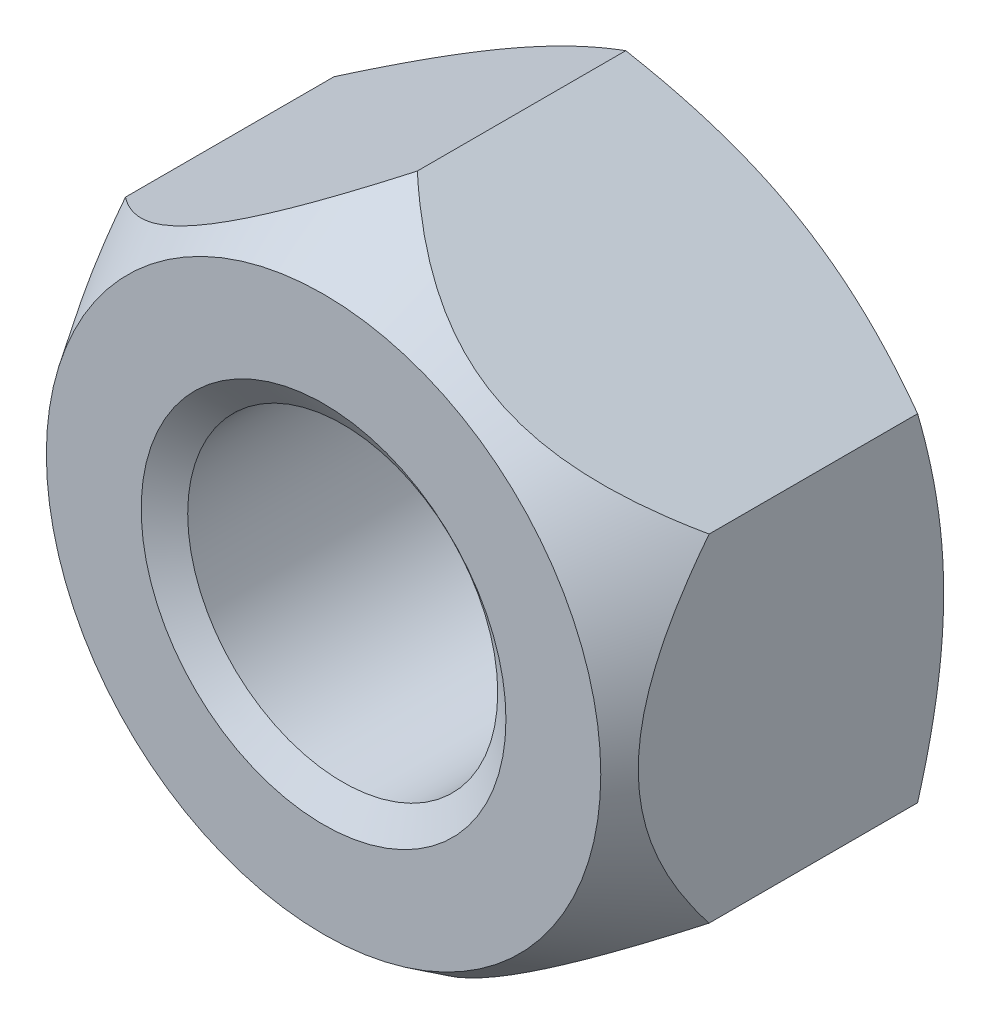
ISO-10303-21;
HEADER;
FILE_DESCRIPTION(('STEP AP214'),'2;1');
FILE_NAME('part.step','',(''),(''),'','','');
FILE_SCHEMA(('AUTOMOTIVE_DESIGN { 1 0 10303 214 1 1 1 1 }'));
ENDSEC;
DATA;
#1=APPLICATION_CONTEXT('core data for automotive mechanical design processes');
#2=APPLICATION_PROTOCOL_DEFINITION('international standard','automotive_design',2000,#1);
#3=PRODUCT_CONTEXT('',#1,'mechanical');
#4=PRODUCT('Part','Part','',(#3));
#5=PRODUCT_RELATED_PRODUCT_CATEGORY('part','',(#4));
#6=PRODUCT_DEFINITION_FORMATION('','',#4);
#7=PRODUCT_DEFINITION_CONTEXT('part definition',#1,'design');
#8=PRODUCT_DEFINITION('design','',#6,#7);
#9=PRODUCT_DEFINITION_SHAPE('','',#8);
#10=(LENGTH_UNIT() NAMED_UNIT(*) SI_UNIT(.MILLI.,.METRE.));
#11=(NAMED_UNIT(*) PLANE_ANGLE_UNIT() SI_UNIT($,.RADIAN.));
#12=(NAMED_UNIT(*) SI_UNIT($,.STERADIAN.) SOLID_ANGLE_UNIT());
#13=UNCERTAINTY_MEASURE_WITH_UNIT(LENGTH_MEASURE(1.E-05),#10,'distance_accuracy_value','');
#14=(GEOMETRIC_REPRESENTATION_CONTEXT(3) GLOBAL_UNCERTAINTY_ASSIGNED_CONTEXT((#13)) GLOBAL_UNIT_ASSIGNED_CONTEXT((#10,
#11,#12)) REPRESENTATION_CONTEXT('',''));
#15=CARTESIAN_POINT('',(0.,0.,0.));
#16=DIRECTION('',(0.,0.,1.));
#17=DIRECTION('',(1.,0.,0.));
#18=AXIS2_PLACEMENT_3D('',#15,#16,#17);
#19=CARTESIAN_POINT('',(0.,0.,-9.));
#20=DIRECTION('',(0.,0.,1.));
#21=DIRECTION('',(1.,0.,0.));
#22=AXIS2_PLACEMENT_3D('',#19,#20,#21);
#23=CYLINDRICAL_SURFACE('',#22,4.25);
#24=CARTESIAN_POINT('',(0.,0.,-0.525155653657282));
#25=DIRECTION('',(0.,0.,1.));
#26=DIRECTION('',(1.,0.,0.));
#27=AXIS2_PLACEMENT_3D('',#24,#25,#26);
#28=CIRCLE('',#27,4.25);
#29=CARTESIAN_POINT('',(4.25,0.,-0.525155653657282));
#30=VERTEX_POINT('',#29);
#31=EDGE_CURVE('E146',#30,#30,#28,.F.);
#32=ORIENTED_EDGE('',*,*,#31,.F.);
#33=EDGE_LOOP('',(#32));
#34=FACE_BOUND('',#33,.T.);
#35=CARTESIAN_POINT('',(0.,0.,-8.44944434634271));
#36=DIRECTION('',(0.,0.,-1.));
#37=DIRECTION('',(-1.,0.,0.));
#38=AXIS2_PLACEMENT_3D('',#35,#36,#37);
#39=CIRCLE('',#38,4.25);
#40=CARTESIAN_POINT('',(-4.25,0.,-8.44944434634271));
#41=VERTEX_POINT('',#40);
#42=EDGE_CURVE('E35',#41,#41,#39,.F.);
#43=ORIENTED_EDGE('',*,*,#42,.F.);
#44=EDGE_LOOP('',(#43));
#45=FACE_BOUND('',#44,.T.);
#46=ADVANCED_FACE('F30',(#34,#45),#23,.F.);
#47=CARTESIAN_POINT('',(0.,9.23760430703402,-9.));
#48=DIRECTION('',(0.,0.,-1.));
#49=DIRECTION('',(-1.,0.,0.));
#50=AXIS2_PLACEMENT_3D('',#47,#48,#49);
#51=PLANE('',#50);
#52=CARTESIAN_POINT('',(0.,0.,-9.));
#53=DIRECTION('',(0.,0.,-1.));
#54=DIRECTION('',(-1.,0.,0.));
#55=AXIS2_PLACEMENT_3D('',#52,#53,#54);
#56=CIRCLE('',#55,8.);
#57=CARTESIAN_POINT('',(-8.,0.,-9.));
#58=VERTEX_POINT('',#57);
#59=CARTESIAN_POINT('',(-4.00000000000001,-6.92820323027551,-9.));
#60=VERTEX_POINT('',#59);
#61=EDGE_CURVE('E11',#58,#60,#56,.F.);
#62=ORIENTED_EDGE('',*,*,#61,.F.);
#63=CARTESIAN_POINT('',(-4.,6.92820323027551,-9.));
#64=VERTEX_POINT('',#63);
#65=EDGE_CURVE('E42',#64,#58,#56,.F.);
#66=ORIENTED_EDGE('',*,*,#65,.F.);
#67=CARTESIAN_POINT('',(4.00000000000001,6.9282032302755,-9.));
#68=VERTEX_POINT('',#67);
#69=EDGE_CURVE('E145',#68,#64,#56,.F.);
#70=ORIENTED_EDGE('',*,*,#69,.F.);
#71=CARTESIAN_POINT('',(0.,0.,-9.));
#72=DIRECTION('',(0.,0.,1.));
#73=DIRECTION('',(1.,0.,0.));
#74=AXIS2_PLACEMENT_3D('',#71,#72,#73);
#75=CIRCLE('',#74,8.);
#76=CARTESIAN_POINT('',(8.,0.,-9.));
#77=VERTEX_POINT('',#76);
#78=EDGE_CURVE('E426',#77,#68,#75,.T.);
#79=ORIENTED_EDGE('',*,*,#78,.F.);
#80=CARTESIAN_POINT('',(4.,-6.92820323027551,-9.));
#81=VERTEX_POINT('',#80);
#82=EDGE_CURVE('E440',#81,#77,#56,.F.);
#83=ORIENTED_EDGE('',*,*,#82,.F.);
#84=EDGE_CURVE('E40',#60,#81,#56,.F.);
#85=ORIENTED_EDGE('',*,*,#84,.F.);
#86=EDGE_LOOP('',(#62,#66,#70,#79,#83,#85));
#87=FACE_BOUND('',#86,.T.);
#88=CARTESIAN_POINT('',(0.,0.,-9.));
#89=DIRECTION('',(0.,0.,-1.));
#90=DIRECTION('',(-1.,0.,0.));
#91=AXIS2_PLACEMENT_3D('',#88,#89,#90);
#92=CIRCLE('',#91,5.);
#93=CARTESIAN_POINT('',(-5.,0.,-9.));
#94=VERTEX_POINT('',#93);
#95=EDGE_CURVE('E150',#94,#94,#92,.F.);
#96=ORIENTED_EDGE('',*,*,#95,.T.);
#97=EDGE_LOOP('',(#96));
#98=FACE_BOUND('',#97,.T.);
#99=ADVANCED_FACE('F214',(#87,#98),#51,.T.);
#100=CARTESIAN_POINT('',(0.,9.23760430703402,0.));
#101=DIRECTION('',(0.,0.,-1.));
#102=DIRECTION('',(-1.,0.,0.));
#103=AXIS2_PLACEMENT_3D('',#100,#101,#102);
#104=PLANE('',#103);
#105=CARTESIAN_POINT('',(0.,0.,0.));
#106=DIRECTION('',(0.,0.,1.));
#107=DIRECTION('',(1.,0.,0.));
#108=AXIS2_PLACEMENT_3D('',#105,#106,#107);
#109=CIRCLE('',#108,7.6);
#110=CARTESIAN_POINT('',(7.6,0.,0.));
#111=VERTEX_POINT('',#110);
#112=EDGE_CURVE('E148',#111,#111,#109,.T.);
#113=ORIENTED_EDGE('',*,*,#112,.T.);
#114=EDGE_LOOP('',(#113));
#115=FACE_BOUND('',#114,.T.);
#116=CARTESIAN_POINT('',(0.,0.,0.));
#117=DIRECTION('',(0.,0.,1.));
#118=DIRECTION('',(1.,0.,0.));
#119=AXIS2_PLACEMENT_3D('',#116,#117,#118);
#120=CIRCLE('',#119,5.);
#121=CARTESIAN_POINT('',(5.,0.,0.));
#122=VERTEX_POINT('',#121);
#123=EDGE_CURVE('E149',#122,#122,#120,.T.);
#124=ORIENTED_EDGE('',*,*,#123,.F.);
#125=EDGE_LOOP('',(#124));
#126=FACE_BOUND('',#125,.T.);
#127=ADVANCED_FACE('F266',(#115,#126),#104,.F.);
#128=CARTESIAN_POINT('',(0.,9.23760430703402,-9.));
#129=DIRECTION('',(-0.500000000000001,0.866025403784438,0.));
#130=DIRECTION('',(-0.866025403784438,-0.500000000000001,0.));
#131=AXIS2_PLACEMENT_3D('',#128,#129,#130);
#132=PLANE('',#131);
#133=DIRECTION('',(0.,0.,1.));
#134=VECTOR('',#133,1.);
#135=CARTESIAN_POINT('',(-8.,4.618802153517,-9.));
#136=LINE('',#135,#134);
#137=CARTESIAN_POINT('',(-8.,4.61880215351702,-8.28546882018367));
#138=VERTEX_POINT('',#137);
#139=CARTESIAN_POINT('',(-8.,4.618802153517,-2.56999999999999));
#140=VERTEX_POINT('',#139);
#141=EDGE_CURVE('E140',#138,#140,#136,.T.);
#142=ORIENTED_EDGE('',*,*,#141,.T.);
#143=CARTESIAN_POINT('',(-8.0002,4.61868668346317,-2.5701812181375));
#144=CARTESIAN_POINT('',(-7.9150840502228,4.66782839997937,-2.49306399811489));
#145=CARTESIAN_POINT('',(-7.8291989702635,4.71741417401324,-2.41708127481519));
#146=CARTESIAN_POINT('',(-7.65573743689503,4.81756223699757,-2.2676826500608));
#147=CARTESIAN_POINT('',(-7.56816055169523,4.86812477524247,-2.19426741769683));
#148=CARTESIAN_POINT('',(-7.30199770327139,5.02179396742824,-1.97778422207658));
#149=CARTESIAN_POINT('',(-7.12068103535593,5.1264771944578,-1.8391216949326));
#150=CARTESIAN_POINT('',(-6.74583954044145,5.34289203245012,-1.57413307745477));
#151=CARTESIAN_POINT('',(-6.55213408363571,5.45472793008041,-1.44814466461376));
#152=CARTESIAN_POINT('',(-6.1557929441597,5.68355559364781,-1.21711956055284));
#153=CARTESIAN_POINT('',(-5.95317372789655,5.80053785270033,-1.11204606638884));
#154=CARTESIAN_POINT('',(-5.61980314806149,5.99300944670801,-0.964407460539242));
#155=CARTESIAN_POINT('',(-5.49183349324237,6.06689276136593,-0.913443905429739));
#156=CARTESIAN_POINT('',(-5.23286494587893,6.21640832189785,-0.822900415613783));
#157=CARTESIAN_POINT('',(-5.10186591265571,6.29204064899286,-0.783321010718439));
#158=CARTESIAN_POINT('',(-4.83847998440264,6.44410658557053,-0.717166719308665));
#159=CARTESIAN_POINT('',(-4.70611197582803,6.52052929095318,-0.69049247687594));
#160=CARTESIAN_POINT('',(-4.43984570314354,6.67425819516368,-0.650725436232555));
#161=CARTESIAN_POINT('',(-4.30594753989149,6.75156433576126,-0.637631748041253));
#162=CARTESIAN_POINT('',(-4.03675995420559,6.90697986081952,-0.625539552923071));
#163=CARTESIAN_POINT('',(-3.90146725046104,6.98509113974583,-0.626637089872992));
#164=CARTESIAN_POINT('',(-3.63154168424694,7.14093273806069,-0.643111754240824));
#165=CARTESIAN_POINT('',(-3.49690883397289,7.21866305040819,-0.658489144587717));
#166=CARTESIAN_POINT('',(-3.22895584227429,7.37336578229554,-0.702935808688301));
#167=CARTESIAN_POINT('',(-3.09564081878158,7.45033524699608,-0.732045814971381));
#168=CARTESIAN_POINT('',(-2.8314914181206,7.60284197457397,-0.802859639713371));
#169=CARTESIAN_POINT('',(-2.7006586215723,7.67837832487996,-0.844571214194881));
#170=CARTESIAN_POINT('',(-2.39018809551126,7.85762856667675,-0.958197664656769));
#171=CARTESIAN_POINT('',(-2.21203247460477,7.96048676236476,-1.03551593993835));
#172=CARTESIAN_POINT('',(-1.86238556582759,8.16235549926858,-1.20820630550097));
#173=CARTESIAN_POINT('',(-1.69089923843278,8.26136317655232,-1.30359153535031));
#174=CARTESIAN_POINT('',(-1.35427835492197,8.45571133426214,-1.50897141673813));
#175=CARTESIAN_POINT('',(-1.18915625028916,8.55104462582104,-1.61899300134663));
#176=CARTESIAN_POINT('',(-0.865174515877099,8.73809556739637,-1.85050146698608));
#177=CARTESIAN_POINT('',(-0.706312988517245,8.82981431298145,-1.97198483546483));
#178=CARTESIAN_POINT('',(-0.456379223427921,8.97411363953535,-2.17386560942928));
#179=CARTESIAN_POINT('',(-0.363518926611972,9.02772655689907,-2.251345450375));
#180=CARTESIAN_POINT('',(-0.180092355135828,9.13362793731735,-2.40886778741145));
#181=CARTESIAN_POINT('',(-0.0895176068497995,9.18592129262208,-2.4888971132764));
#182=CARTESIAN_POINT('',(0.000200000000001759,9.23771977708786,-2.57018121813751));
#183=B_SPLINE_CURVE_WITH_KNOTS('',3,(#143,#144,#145,#146,#147,#148,#149,#150,#151,#152,#153,
#154,#155,#156,#157,#158,#159,#160,#161,#162,#163,#164,#165,#166,#167,#168,#169,#170,#171,#172,
#173,#174,#175,#176,#177,#178,#179,#180,#181,#182),.UNSPECIFIED.,.F.,.F.,(4,2,2,2,2,2,2,2,2,2,2,
2,2,2,2,2,2,2,2,4),(0.,0.374763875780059,0.749624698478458,1.50244478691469,2.27179273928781,
3.03977470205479,3.50831689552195,3.97688089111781,4.44177765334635,4.90664394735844,
5.37465801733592,5.84268070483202,6.31210041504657,6.78180963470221,7.43999639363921,
8.09866368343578,8.75856023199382,9.41825520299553,9.81507961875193,10.2101098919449),.UNSPECIFIED.);
#184=CARTESIAN_POINT('',(0.,9.23760430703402,-2.57));
#185=VERTEX_POINT('',#184);
#186=EDGE_CURVE('E49',#140,#185,#183,.T.);
#187=ORIENTED_EDGE('',*,*,#186,.T.);
#188=DIRECTION('',(0.,0.,1.));
#189=VECTOR('',#188,1.);
#190=CARTESIAN_POINT('',(0.,9.23760430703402,-9.));
#191=LINE('',#190,#189);
#192=CARTESIAN_POINT('',(0.,9.23760430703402,-8.28546882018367));
#193=VERTEX_POINT('',#192);
#194=EDGE_CURVE('E122',#193,#185,#191,.T.);
#195=ORIENTED_EDGE('',*,*,#194,.F.);
#196=CARTESIAN_POINT('',(-8.0002,4.61868668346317,-8.28540215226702));
#197=CARTESIAN_POINT('',(-7.8243512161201,4.72021302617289,-8.34400928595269));
#198=CARTESIAN_POINT('',(-7.64784680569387,4.82211789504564,-8.3999565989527));
#199=CARTESIAN_POINT('',(-7.29340453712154,5.02675523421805,-8.50579899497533));
#200=CARTESIAN_POINT('',(-7.11546609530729,5.12948804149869,-8.55569146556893));
#201=CARTESIAN_POINT('',(-6.57880176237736,5.43933133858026,-8.69530720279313));
#202=CARTESIAN_POINT('',(-6.21795741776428,5.64766491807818,-8.77471882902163));
#203=CARTESIAN_POINT('',(-5.67796082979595,5.95943209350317,-8.86783835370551));
#204=CARTESIAN_POINT('',(-5.50042181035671,6.06193429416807,-8.89436541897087));
#205=CARTESIAN_POINT('',(-5.1445408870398,6.26740224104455,-8.93884682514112));
#206=CARTESIAN_POINT('',(-4.96619905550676,6.37036794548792,-8.95680192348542));
#207=CARTESIAN_POINT('',(-4.6092083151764,6.57647664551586,-8.98368435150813));
#208=CARTESIAN_POINT('',(-4.4305599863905,6.67961930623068,-8.99262192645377));
#209=CARTESIAN_POINT('',(-4.07309829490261,6.88599991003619,-9.00127769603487));
#210=CARTESIAN_POINT('',(-3.89428493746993,6.98923785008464,-9.00099617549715));
#211=CARTESIAN_POINT('',(-3.55998663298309,7.18224506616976,-8.99185497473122));
#212=CARTESIAN_POINT('',(-3.40447809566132,7.27202796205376,-8.98411039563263));
#213=CARTESIAN_POINT('',(-3.09382523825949,7.45138347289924,-8.96179886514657));
#214=CARTESIAN_POINT('',(-2.93868094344,7.54095607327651,-8.94723145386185));
#215=CARTESIAN_POINT('',(-2.47384868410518,7.80932710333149,-8.89363930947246));
#216=CARTESIAN_POINT('',(-2.16498351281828,7.98765049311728,-8.84473135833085));
#217=CARTESIAN_POINT('',(-1.5439767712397,8.34618890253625,-8.72246059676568));
#218=CARTESIAN_POINT('',(-1.23191445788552,8.52635816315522,-8.648579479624));
#219=CARTESIAN_POINT('',(-0.61244351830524,8.88400987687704,-8.48089985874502));
#220=CARTESIAN_POINT('',(-0.305026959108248,9.06149691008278,-8.38714073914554));
#221=CARTESIAN_POINT('',(0.000200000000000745,9.23771977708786,-8.28540215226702));
#222=B_SPLINE_CURVE_WITH_KNOTS('',3,(#196,#197,#198,#199,#200,#201,#202,#203,#204,#205,#206,
#207,#208,#209,#210,#211,#212,#213,#214,#215,#216,#217,#218,#219,#220,#221),.UNSPECIFIED.,.F.,
.F.,(4,2,2,2,2,2,2,2,2,2,2,2,4),(0.,0.633973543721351,1.26821965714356,2.53934712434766,
3.15934343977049,3.77928496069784,4.39852133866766,5.01773858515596,5.55680239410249,
6.09590254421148,7.17487077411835,8.27776850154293,9.37850115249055),.UNSPECIFIED.);
#223=EDGE_CURVE('E142',#64,#193,#222,.T.);
#224=ORIENTED_EDGE('',*,*,#223,.F.);
#225=EDGE_CURVE('E224',#138,#64,#222,.T.);
#226=ORIENTED_EDGE('',*,*,#225,.F.);
#227=EDGE_LOOP('',(#142,#187,#195,#224,#226));
#228=FACE_BOUND('',#227,.T.);
#229=ADVANCED_FACE('F32',(#228),#132,.T.);
#230=CARTESIAN_POINT('',(8.,4.618802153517,-9.));
#231=DIRECTION('',(0.500000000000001,0.866025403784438,0.));
#232=DIRECTION('',(-0.866025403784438,0.500000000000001,0.));
#233=AXIS2_PLACEMENT_3D('',#230,#231,#232);
#234=PLANE('',#233);
#235=ORIENTED_EDGE('',*,*,#194,.T.);
#236=CARTESIAN_POINT('',(-0.000199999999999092,9.23771977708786,-2.57018121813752));
#237=CARTESIAN_POINT('',(0.0849159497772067,9.18857806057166,-2.4930639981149));
#238=CARTESIAN_POINT('',(0.170801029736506,9.13899228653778,-2.4170812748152));
#239=CARTESIAN_POINT('',(0.344262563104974,9.03884422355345,-2.26768265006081));
#240=CARTESIAN_POINT('',(0.431839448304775,8.98828168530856,-2.19426741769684));
#241=CARTESIAN_POINT('',(0.698002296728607,8.83461249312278,-1.97778422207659));
#242=CARTESIAN_POINT('',(0.879318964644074,8.72992926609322,-1.83912169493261));
#243=CARTESIAN_POINT('',(1.25416045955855,8.51351442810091,-1.57413307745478));
#244=CARTESIAN_POINT('',(1.44786591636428,8.40167853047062,-1.44814466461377));
#245=CARTESIAN_POINT('',(1.8442070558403,8.17285086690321,-1.21711956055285));
#246=CARTESIAN_POINT('',(2.04682627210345,8.05586860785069,-1.11204606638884));
#247=CARTESIAN_POINT('',(2.38019685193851,7.86339701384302,-0.964407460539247));
#248=CARTESIAN_POINT('',(2.50816650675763,7.78951369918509,-0.913443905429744));
#249=CARTESIAN_POINT('',(2.76713505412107,7.63999813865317,-0.822900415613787));
#250=CARTESIAN_POINT('',(2.89813408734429,7.56436581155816,-0.783321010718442));
#251=CARTESIAN_POINT('',(3.16152001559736,7.41229987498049,-0.717166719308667));
#252=CARTESIAN_POINT('',(3.29388802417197,7.33587716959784,-0.690492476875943));
#253=CARTESIAN_POINT('',(3.56015429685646,7.18214826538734,-0.650725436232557));
#254=CARTESIAN_POINT('',(3.69405246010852,7.10484212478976,-0.637631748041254));
#255=CARTESIAN_POINT('',(3.96324004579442,6.9494265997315,-0.625539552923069));
#256=CARTESIAN_POINT('',(4.09853274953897,6.87131532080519,-0.626637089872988));
#257=CARTESIAN_POINT('',(4.36845831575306,6.71547372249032,-0.643111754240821));
#258=CARTESIAN_POINT('',(4.50309116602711,6.63774341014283,-0.658489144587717));
#259=CARTESIAN_POINT('',(4.77104415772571,6.48304067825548,-0.702935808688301));
#260=CARTESIAN_POINT('',(4.90435918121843,6.40607121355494,-0.732045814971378));
#261=CARTESIAN_POINT('',(5.1685085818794,6.25356448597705,-0.802859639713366));
#262=CARTESIAN_POINT('',(5.2993413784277,6.17802813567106,-0.844571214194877));
#263=CARTESIAN_POINT('',(5.60981190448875,5.99877789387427,-0.958197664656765));
#264=CARTESIAN_POINT('',(5.78796752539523,5.89591969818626,-1.03551593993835));
#265=CARTESIAN_POINT('',(6.13761443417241,5.69405096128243,-1.20820630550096));
#266=CARTESIAN_POINT('',(6.30910076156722,5.5950432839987,-1.3035915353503));
#267=CARTESIAN_POINT('',(6.64572164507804,5.40069512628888,-1.50897141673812));
#268=CARTESIAN_POINT('',(6.81084374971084,5.30536183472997,-1.61899300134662));
#269=CARTESIAN_POINT('',(7.1348254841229,5.11831089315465,-1.85050146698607));
#270=CARTESIAN_POINT('',(7.29368701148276,5.02659214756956,-1.97198483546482));
#271=CARTESIAN_POINT('',(7.54362077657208,4.88229282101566,-2.17386560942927));
#272=CARTESIAN_POINT('',(7.63648107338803,4.82867990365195,-2.25134545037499));
#273=CARTESIAN_POINT('',(7.81990764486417,4.72277852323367,-2.40886778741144));
#274=CARTESIAN_POINT('',(7.9104823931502,4.67048516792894,-2.48889711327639));
#275=CARTESIAN_POINT('',(8.0002,4.61868668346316,-2.5701812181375));
#276=B_SPLINE_CURVE_WITH_KNOTS('',3,(#236,#237,#238,#239,#240,#241,#242,#243,#244,#245,#246,
#247,#248,#249,#250,#251,#252,#253,#254,#255,#256,#257,#258,#259,#260,#261,#262,#263,#264,#265,
#266,#267,#268,#269,#270,#271,#272,#273,#274,#275),.UNSPECIFIED.,.F.,.F.,(4,2,2,2,2,2,2,2,2,2,2,
2,2,2,2,2,2,2,2,4),(0.,0.374763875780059,0.749624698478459,1.50244478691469,2.27179273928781,
3.03977470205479,3.50831689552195,3.97688089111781,4.44177765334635,4.90664394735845,
5.37465801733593,5.84268070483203,6.31210041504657,6.78180963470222,7.43999639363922,
8.09866368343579,8.75856023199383,9.41825520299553,9.81507961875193,10.2101098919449),.UNSPECIFIED.);
#277=CARTESIAN_POINT('',(8.,4.61880215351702,-2.57));
#278=VERTEX_POINT('',#277);
#279=EDGE_CURVE('E106',#185,#278,#276,.T.);
#280=ORIENTED_EDGE('',*,*,#279,.T.);
#281=DIRECTION('',(0.,0.,1.));
#282=VECTOR('',#281,1.);
#283=CARTESIAN_POINT('',(8.,4.618802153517,-9.));
#284=LINE('',#283,#282);
#285=CARTESIAN_POINT('',(8.,4.61880215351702,-8.28546882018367));
#286=VERTEX_POINT('',#285);
#287=EDGE_CURVE('E119',#286,#278,#284,.T.);
#288=ORIENTED_EDGE('',*,*,#287,.F.);
#289=CARTESIAN_POINT('',(-0.000199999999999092,9.23771977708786,-8.28540215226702));
#290=CARTESIAN_POINT('',(0.175648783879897,9.13619343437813,-8.34400928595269));
#291=CARTESIAN_POINT('',(0.352153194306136,9.03428856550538,-8.3999565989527));
#292=CARTESIAN_POINT('',(0.706595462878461,8.82965122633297,-8.50579899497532));
#293=CARTESIAN_POINT('',(0.884533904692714,8.72691841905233,-8.55569146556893));
#294=CARTESIAN_POINT('',(1.42119823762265,8.41707512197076,-8.69530720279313));
#295=CARTESIAN_POINT('',(1.78204258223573,8.20874154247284,-8.77471882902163));
#296=CARTESIAN_POINT('',(2.32203917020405,7.89697436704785,-8.86783835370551));
#297=CARTESIAN_POINT('',(2.49957818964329,7.79447216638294,-8.89436541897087));
#298=CARTESIAN_POINT('',(2.8554591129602,7.58900421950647,-8.93884682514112));
#299=CARTESIAN_POINT('',(3.03380094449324,7.4860385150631,-8.95680192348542));
#300=CARTESIAN_POINT('',(3.3907916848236,7.27992981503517,-8.98368435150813));
#301=CARTESIAN_POINT('',(3.56944001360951,7.17678715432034,-8.99262192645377));
#302=CARTESIAN_POINT('',(3.92690170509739,6.97040655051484,-9.00127769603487));
#303=CARTESIAN_POINT('',(4.10571506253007,6.86716861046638,-9.00099617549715));
#304=CARTESIAN_POINT('',(4.44001336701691,6.67416139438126,-8.99185497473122));
#305=CARTESIAN_POINT('',(4.59552190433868,6.58437849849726,-8.98411039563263));
#306=CARTESIAN_POINT('',(4.90617476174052,6.40502298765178,-8.96179886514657));
#307=CARTESIAN_POINT('',(5.06131905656,6.31545038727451,-8.94723145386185));
#308=CARTESIAN_POINT('',(5.52615131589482,6.04707935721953,-8.89363930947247));
#309=CARTESIAN_POINT('',(5.83501648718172,5.86875596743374,-8.84473135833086));
#310=CARTESIAN_POINT('',(6.4560232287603,5.51021755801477,-8.72246059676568));
#311=CARTESIAN_POINT('',(6.76808554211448,5.3300482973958,-8.648579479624));
#312=CARTESIAN_POINT('',(7.38755648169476,4.97239658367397,-8.48089985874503));
#313=CARTESIAN_POINT('',(7.69497304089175,4.79490955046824,-8.38714073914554));
#314=CARTESIAN_POINT('',(8.0002,4.61868668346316,-8.28540215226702));
#315=B_SPLINE_CURVE_WITH_KNOTS('',3,(#289,#290,#291,#292,#293,#294,#295,#296,#297,#298,#299,
#300,#301,#302,#303,#304,#305,#306,#307,#308,#309,#310,#311,#312,#313,#314),.UNSPECIFIED.,.F.,
.F.,(4,2,2,2,2,2,2,2,2,2,2,2,4),(0.,0.633973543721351,1.26821965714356,2.53934712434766,
3.1593434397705,3.77928496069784,4.39852133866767,5.01773858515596,5.5568023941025,
6.09590254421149,7.17487077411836,8.27776850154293,9.37850115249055),.UNSPECIFIED.);
#316=EDGE_CURVE('E218',#68,#286,#315,.T.);
#317=ORIENTED_EDGE('',*,*,#316,.F.);
#318=EDGE_CURVE('E223',#193,#68,#315,.T.);
#319=ORIENTED_EDGE('',*,*,#318,.F.);
#320=EDGE_LOOP('',(#235,#280,#288,#317,#319));
#321=FACE_BOUND('',#320,.T.);
#322=ADVANCED_FACE('F117',(#321),#234,.T.);
#323=CARTESIAN_POINT('',(8.,4.618802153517,-9.));
#324=DIRECTION('',(-1.,0.,0.));
#325=DIRECTION('',(0.,0.,1.));
#326=AXIS2_PLACEMENT_3D('',#323,#324,#325);
#327=PLANE('',#326);
#328=CARTESIAN_POINT('',(8.,-7.86024496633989,-5.67376251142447));
#329=CARTESIAN_POINT('',(8.,-7.69360265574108,-5.49051370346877));
#330=CARTESIAN_POINT('',(8.,-7.52551201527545,-5.30856186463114));
#331=CARTESIAN_POINT('',(8.,-7.18589984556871,-4.94779933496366));
#332=CARTESIAN_POINT('',(8.,-7.01437740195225,-4.76898950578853));
#333=CARTESIAN_POINT('',(8.,-6.6659235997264,-4.41359400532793));
#334=CARTESIAN_POINT('',(8.,-6.48895783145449,-4.23704196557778));
#335=CARTESIAN_POINT('',(8.,-6.13047397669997,-3.8886396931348));
#336=CARTESIAN_POINT('',(8.,-5.94895627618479,-3.7167890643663));
#337=CARTESIAN_POINT('',(8.,-5.56982178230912,-3.36893457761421));
#338=CARTESIAN_POINT('',(8.,-5.37188503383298,-3.19327786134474));
#339=CARTESIAN_POINT('',(8.,-4.96899493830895,-2.85006919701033));
#340=CARTESIAN_POINT('',(8.,-4.76404016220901,-2.68251891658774));
#341=CARTESIAN_POINT('',(8.,-4.34672007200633,-2.35846297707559));
#342=CARTESIAN_POINT('',(8.,-4.13438439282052,-2.20191939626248));
#343=CARTESIAN_POINT('',(8.,-3.70040368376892,-1.90239818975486));
#344=CARTESIAN_POINT('',(8.,-3.47876388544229,-1.75941308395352));
#345=CARTESIAN_POINT('',(8.,-3.08674477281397,-1.52775334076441));
#346=CARTESIAN_POINT('',(8.,-2.91884676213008,-1.43489380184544));
#347=CARTESIAN_POINT('',(8.,-2.5770804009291,-1.26064987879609));
#348=CARTESIAN_POINT('',(8.,-2.40321042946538,-1.17926864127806));
#349=CARTESIAN_POINT('',(8.,-2.05133471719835,-1.03121585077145));
#350=CARTESIAN_POINT('',(8.,-1.87338877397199,-0.964403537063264));
#351=CARTESIAN_POINT('',(8.,-1.51222132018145,-0.847078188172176));
#352=CARTESIAN_POINT('',(8.,-1.32900277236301,-0.796556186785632));
#353=CARTESIAN_POINT('',(8.,-0.998837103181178,-0.723221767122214));
#354=CARTESIAN_POINT('',(8.,-0.852697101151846,-0.69676875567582));
#355=CARTESIAN_POINT('',(8.,-0.558707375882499,-0.656230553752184));
#356=CARTESIAN_POINT('',(8.,-0.410857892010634,-0.642143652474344));
#357=CARTESIAN_POINT('',(8.,-0.114418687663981,-0.626876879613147));
#358=CARTESIAN_POINT('',(8.,0.0341713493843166,-0.62570310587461));
#359=CARTESIAN_POINT('',(8.,0.330889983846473,-0.636324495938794));
#360=CARTESIAN_POINT('',(8.,0.479018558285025,-0.648120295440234));
#361=CARTESIAN_POINT('',(8.,0.773101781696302,-0.684144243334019));
#362=CARTESIAN_POINT('',(8.,0.919062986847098,-0.708319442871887));
#363=CARTESIAN_POINT('',(8.,1.2086026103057,-0.768214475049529));
#364=CARTESIAN_POINT('',(8.,1.35218056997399,-0.803936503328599));
#365=CARTESIAN_POINT('',(8.,1.63639958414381,-0.885830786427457));
#366=CARTESIAN_POINT('',(8.,1.77703872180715,-0.932009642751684));
#367=CARTESIAN_POINT('',(8.,2.05492990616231,-1.03358402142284));
#368=CARTESIAN_POINT('',(8.,2.19218159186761,-1.08898052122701));
#369=CARTESIAN_POINT('',(8.,2.57894278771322,-1.2585472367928));
#370=CARTESIAN_POINT('',(8.,2.82418221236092,-1.38249737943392));
#371=CARTESIAN_POINT('',(8.,3.30299225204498,-1.65120454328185));
#372=CARTESIAN_POINT('',(8.,3.53655193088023,-1.79598059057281));
#373=CARTESIAN_POINT('',(8.,3.99562650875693,-2.10276088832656));
#374=CARTESIAN_POINT('',(8.,4.22102800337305,-2.26493353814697));
#375=CARTESIAN_POINT('',(8.,4.55211032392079,-2.51716244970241));
#376=CARTESIAN_POINT('',(8.,4.66127855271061,-2.60271452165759));
#377=CARTESIAN_POINT('',(8.,4.87748553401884,-2.77646597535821));
#378=CARTESIAN_POINT('',(8.,4.98452434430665,-2.86466528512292));
#379=CARTESIAN_POINT('',(8.,5.31422074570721,-3.14243183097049));
#380=CARTESIAN_POINT('',(8.,5.533519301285,-3.3359915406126));
#381=CARTESIAN_POINT('',(8.,5.96487092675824,-3.73105204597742));
#382=CARTESIAN_POINT('',(8.,6.17692240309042,-3.93255456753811));
#383=CARTESIAN_POINT('',(8.,6.59507539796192,-4.34195173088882));
#384=CARTESIAN_POINT('',(8.,6.8011720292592,-4.54985134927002));
#385=CARTESIAN_POINT('',(8.,7.20817500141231,-4.97062372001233));
#386=CARTESIAN_POINT('',(8.,7.40908172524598,-5.18349610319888));
#387=CARTESIAN_POINT('',(8.,7.80731634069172,-5.61417938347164));
#388=CARTESIAN_POINT('',(8.,8.00462613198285,-5.83200698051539));
#389=CARTESIAN_POINT('',(8.,8.39545508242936,-6.27104115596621));
#390=CARTESIAN_POINT('',(8.,8.58897411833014,-6.49224784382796));
#391=CARTESIAN_POINT('',(8.,9.16448294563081,-7.15986425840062));
#392=CARTESIAN_POINT('',(8.,9.54160685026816,-7.61046984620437));
#393=CARTESIAN_POINT('',(8.,10.2512574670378,-8.47720724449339));
#394=CARTESIAN_POINT('',(8.,10.5846593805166,-8.89262741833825));
#395=CARTESIAN_POINT('',(8.,11.245087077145,-9.72858077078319));
#396=CARTESIAN_POINT('',(8.,11.5721120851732,-10.1491145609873));
#397=CARTESIAN_POINT('',(8.,12.2181196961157,-10.9904115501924));
#398=CARTESIAN_POINT('',(8.,12.5371478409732,-11.411139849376));
#399=CARTESIAN_POINT('',(8.,13.0125277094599,-12.0445357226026));
#400=CARTESIAN_POINT('',(8.,13.1704453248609,-12.2560307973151));
#401=CARTESIAN_POINT('',(8.,13.4853265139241,-12.6797278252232));
#402=CARTESIAN_POINT('',(8.,13.6422900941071,-12.8919297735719));
#403=CARTESIAN_POINT('',(8.,13.7988224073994,-13.1044494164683));
#404=B_SPLINE_CURVE_WITH_KNOTS('',3,(#328,#329,#330,#331,#332,#333,#334,#335,#336,#337,#338,
#339,#340,#341,#342,#343,#344,#345,#346,#347,#348,#349,#350,#351,#352,#353,#354,#355,#356,#357,
#358,#359,#360,#361,#362,#363,#364,#365,#366,#367,#368,#369,#370,#371,#372,#373,#374,#375,#376,
#377,#378,#379,#380,#381,#382,#383,#384,#385,#386,#387,#388,#389,#390,#391,#392,#393,#394,#395,
#396,#397,#398,#399,#400,#401,#402,#403),.UNSPECIFIED.,.F.,.F.,(4,2,2,2,2,2,2,2,2,2,2,2,2,2,2,2,
2,2,2,2,2,2,2,2,2,2,2,2,2,2,2,2,2,2,2,2,2,4),(0.,0.743081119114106,1.48636293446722,
2.2362149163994,2.98600353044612,3.77974817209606,4.57365541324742,5.36467773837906,
6.15526109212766,6.73050551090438,7.30590731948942,7.87547578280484,8.44473021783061,
8.88979572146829,9.33479964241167,9.78001369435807,10.2252495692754,10.6685968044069,
11.112028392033,11.5557407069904,11.999500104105,12.822369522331,13.6459955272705,
14.4784712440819,14.8945314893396,15.3105804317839,16.1878064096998,17.0652240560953,
17.9433424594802,18.8213958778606,19.7030576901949,20.5847481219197,22.3473183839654,
23.9452432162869,25.5433610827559,27.127349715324,27.9191892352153,28.7110233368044),.UNSPECIFIED.);
#405=CARTESIAN_POINT('',(8.,-4.61880215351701,-2.57));
#406=VERTEX_POINT('',#405);
#407=EDGE_CURVE('E103',#406,#278,#404,.T.);
#408=ORIENTED_EDGE('',*,*,#407,.F.);
#409=DIRECTION('',(0.,0.,1.));
#410=VECTOR('',#409,1.);
#411=CARTESIAN_POINT('',(8.,-4.61880215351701,-9.));
#412=LINE('',#411,#410);
#413=CARTESIAN_POINT('',(8.,-4.61880215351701,-8.28546882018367));
#414=VERTEX_POINT('',#413);
#415=EDGE_CURVE('E128',#414,#406,#412,.T.);
#416=ORIENTED_EDGE('',*,*,#415,.F.);
#417=CARTESIAN_POINT('',(8.,-12.2497439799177,-5.17178635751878));
#418=CARTESIAN_POINT('',(8.,-11.8984987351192,-5.34152745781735));
#419=CARTESIAN_POINT('',(8.,-11.5464230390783,-5.50958119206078));
#420=CARTESIAN_POINT('',(8.,-10.8401616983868,-5.84134970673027));
#421=CARTESIAN_POINT('',(8.,-10.4859757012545,-6.00506373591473));
#422=CARTESIAN_POINT('',(8.,-9.77313142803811,-6.32805107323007));
#423=CARTESIAN_POINT('',(8.,-9.41445915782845,-6.48729360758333));
#424=CARTESIAN_POINT('',(8.,-8.69416671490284,-6.79893883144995));
#425=CARTESIAN_POINT('',(8.,-8.33254669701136,-6.95134187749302));
#426=CARTESIAN_POINT('',(8.,-7.60129405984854,-7.24929869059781));
#427=CARTESIAN_POINT('',(8.,-7.23161757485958,-7.39474539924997));
#428=CARTESIAN_POINT('',(8.,-6.48790521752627,-7.67424757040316));
#429=CARTESIAN_POINT('',(8.,-6.11386886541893,-7.80830176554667));
#430=CARTESIAN_POINT('',(8.,-5.36160531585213,-8.06141638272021));
#431=CARTESIAN_POINT('',(8.,-4.98338896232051,-8.18050868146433));
#432=CARTESIAN_POINT('',(8.,-4.22159300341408,-8.39983373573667));
#433=CARTESIAN_POINT('',(8.,-3.83801513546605,-8.50007245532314));
#434=CARTESIAN_POINT('',(8.,-3.06517005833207,-8.67681673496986));
#435=CARTESIAN_POINT('',(8.,-2.67590136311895,-8.75331597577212));
#436=CARTESIAN_POINT('',(8.,-2.08857290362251,-8.84642984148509));
#437=CARTESIAN_POINT('',(8.,-1.89220175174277,-8.87386398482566));
#438=CARTESIAN_POINT('',(8.,-1.49853877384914,-8.92098081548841));
#439=CARTESIAN_POINT('',(8.,-1.30124704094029,-8.94066427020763));
#440=CARTESIAN_POINT('',(8.,-0.907261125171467,-8.97175001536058));
#441=CARTESIAN_POINT('',(8.,-0.710571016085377,-8.98320372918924));
#442=CARTESIAN_POINT('',(8.,-0.316882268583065,-8.99776943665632));
#443=CARTESIAN_POINT('',(8.,-0.119883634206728,-9.00088153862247));
#444=CARTESIAN_POINT('',(8.,0.274012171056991,-8.99868986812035));
#445=CARTESIAN_POINT('',(8.,0.470909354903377,-8.99338845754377));
#446=CARTESIAN_POINT('',(8.,0.864308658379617,-8.97450159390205));
#447=CARTESIAN_POINT('',(8.,1.06081075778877,-8.96091572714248));
#448=CARTESIAN_POINT('',(8.,1.53707134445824,-8.91823147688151));
#449=CARTESIAN_POINT('',(8.,1.81646391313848,-8.88498228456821));
#450=CARTESIAN_POINT('',(8.,2.37310809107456,-8.80358169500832));
#451=CARTESIAN_POINT('',(8.,2.65035909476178,-8.75542623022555));
#452=CARTESIAN_POINT('',(8.,3.20249141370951,-8.64592101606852));
#453=CARTESIAN_POINT('',(8.,3.4773702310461,-8.58455879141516));
#454=CARTESIAN_POINT('',(8.,4.02429975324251,-8.45051229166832));
#455=CARTESIAN_POINT('',(8.,4.29635072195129,-8.37782908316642));
#456=CARTESIAN_POINT('',(8.,4.84432510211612,-8.22097954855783));
#457=CARTESIAN_POINT('',(8.,5.12017997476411,-8.13657541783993));
#458=CARTESIAN_POINT('',(8.,5.66897392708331,-7.95942754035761));
#459=CARTESIAN_POINT('',(8.,5.94191487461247,-7.86668954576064));
#460=CARTESIAN_POINT('',(8.,6.48378576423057,-7.67478953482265));
#461=CARTESIAN_POINT('',(8.,6.7527296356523,-7.57566661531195));
#462=CARTESIAN_POINT('',(8.,7.28853074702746,-7.37160282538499));
#463=CARTESIAN_POINT('',(8.,7.55538709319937,-7.26665960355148));
#464=CARTESIAN_POINT('',(8.,7.82127397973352,-7.15938198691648));
#465=B_SPLINE_CURVE_WITH_KNOTS('',3,(#417,#418,#419,#420,#421,#422,#423,#424,#425,#426,#427,
#428,#429,#430,#431,#432,#433,#434,#435,#436,#437,#438,#439,#440,#441,#442,#443,#444,#445,#446,
#447,#448,#449,#450,#451,#452,#453,#454,#455,#456,#457,#458,#459,#460,#461,#462,#463,#464),
.UNSPECIFIED.,.F.,.F.,(4,2,2,2,2,2,2,2,2,2,2,2,2,2,2,2,2,2,2,2,2,2,2,4),(0.,1.17034358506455,
2.3408884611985,3.51813189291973,4.69531388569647,5.88694801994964,7.07871454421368,
8.26789729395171,9.45670322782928,10.6458253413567,11.2405311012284,11.8351779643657,
12.4260760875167,13.0169665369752,13.6076911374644,14.1984452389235,15.0420672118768,
15.8859195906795,16.7305726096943,17.5751460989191,18.4404219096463,19.3051050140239,
20.1649211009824,21.0250871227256),.UNSPECIFIED.);
#466=EDGE_CURVE('E230',#414,#77,#465,.T.);
#467=ORIENTED_EDGE('',*,*,#466,.T.);
#468=EDGE_CURVE('E127',#77,#286,#465,.T.);
#469=ORIENTED_EDGE('',*,*,#468,.T.);
#470=ORIENTED_EDGE('',*,*,#287,.T.);
#471=EDGE_LOOP('',(#408,#416,#467,#469,#470));
#472=FACE_BOUND('',#471,.T.);
#473=ADVANCED_FACE('F125',(#472),#327,.F.);
#474=CARTESIAN_POINT('',(0.,-9.23760430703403,-9.));
#475=DIRECTION('',(0.5,-0.866025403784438,0.));
#476=DIRECTION('',(0.866025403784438,0.500000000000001,0.));
#477=AXIS2_PLACEMENT_3D('',#474,#475,#476);
#478=PLANE('',#477);
#479=ORIENTED_EDGE('',*,*,#415,.T.);
#480=CARTESIAN_POINT('',(8.0002,-4.61868668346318,-2.57018121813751));
#481=CARTESIAN_POINT('',(7.91508405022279,-4.66782839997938,-2.4930639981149));
#482=CARTESIAN_POINT('',(7.8291989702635,-4.71741417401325,-2.4170812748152));
#483=CARTESIAN_POINT('',(7.65573743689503,-4.81756223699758,-2.2676826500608));
#484=CARTESIAN_POINT('',(7.56816055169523,-4.86812477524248,-2.19426741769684));
#485=CARTESIAN_POINT('',(7.30199770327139,-5.02179396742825,-1.97778422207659));
#486=CARTESIAN_POINT('',(7.12068103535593,-5.12647719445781,-1.83912169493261));
#487=CARTESIAN_POINT('',(6.74583954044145,-5.34289203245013,-1.57413307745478));
#488=CARTESIAN_POINT('',(6.55213408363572,-5.45472793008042,-1.44814466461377));
#489=CARTESIAN_POINT('',(6.1557929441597,-5.68355559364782,-1.21711956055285));
#490=CARTESIAN_POINT('',(5.95317372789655,-5.80053785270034,-1.11204606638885));
#491=CARTESIAN_POINT('',(5.61980314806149,-5.99300944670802,-0.964407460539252));
#492=CARTESIAN_POINT('',(5.49183349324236,-6.06689276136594,-0.913443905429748));
#493=CARTESIAN_POINT('',(5.23286494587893,-6.21640832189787,-0.822900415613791));
#494=CARTESIAN_POINT('',(5.10186591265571,-6.29204064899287,-0.783321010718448));
#495=CARTESIAN_POINT('',(4.83847998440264,-6.44410658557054,-0.717166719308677));
#496=CARTESIAN_POINT('',(4.70611197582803,-6.52052929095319,-0.690492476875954));
#497=CARTESIAN_POINT('',(4.43984570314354,-6.6742581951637,-0.650725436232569));
#498=CARTESIAN_POINT('',(4.30594753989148,-6.75156433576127,-0.637631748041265));
#499=CARTESIAN_POINT('',(4.03675995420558,-6.90697986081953,-0.625539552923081));
#500=CARTESIAN_POINT('',(3.90146725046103,-6.98509113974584,-0.626637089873));
#501=CARTESIAN_POINT('',(3.63154168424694,-7.14093273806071,-0.643111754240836));
#502=CARTESIAN_POINT('',(3.49690883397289,-7.2186630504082,-0.658489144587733));
#503=CARTESIAN_POINT('',(3.22895584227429,-7.37336578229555,-0.702935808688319));
#504=CARTESIAN_POINT('',(3.09564081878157,-7.45033524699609,-0.732045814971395));
#505=CARTESIAN_POINT('',(2.8314914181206,-7.60284197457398,-0.802859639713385));
#506=CARTESIAN_POINT('',(2.7006586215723,-7.67837832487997,-0.844571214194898));
#507=CARTESIAN_POINT('',(2.39018809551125,-7.85762856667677,-0.958197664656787));
#508=CARTESIAN_POINT('',(2.21203247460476,-7.96048676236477,-1.03551593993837));
#509=CARTESIAN_POINT('',(1.86238556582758,-8.1623554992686,-1.20820630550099));
#510=CARTESIAN_POINT('',(1.69089923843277,-8.26136317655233,-1.30359153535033));
#511=CARTESIAN_POINT('',(1.35427835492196,-8.45571133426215,-1.50897141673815));
#512=CARTESIAN_POINT('',(1.18915625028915,-8.55104462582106,-1.61899300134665));
#513=CARTESIAN_POINT('',(0.865174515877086,-8.73809556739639,-1.8505014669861));
#514=CARTESIAN_POINT('',(0.706312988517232,-8.82981431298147,-1.97198483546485));
#515=CARTESIAN_POINT('',(0.456379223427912,-8.97411363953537,-2.1738656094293));
#516=CARTESIAN_POINT('',(0.363518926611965,-9.02772655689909,-2.25134545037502));
#517=CARTESIAN_POINT('',(0.180092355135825,-9.13362793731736,-2.40886778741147));
#518=CARTESIAN_POINT('',(0.0895176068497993,-9.18592129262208,-2.48889711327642));
#519=CARTESIAN_POINT('',(-0.000199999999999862,-9.23771977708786,-2.57018121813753));
#520=B_SPLINE_CURVE_WITH_KNOTS('',3,(#480,#481,#482,#483,#484,#485,#486,#487,#488,#489,#490,
#491,#492,#493,#494,#495,#496,#497,#498,#499,#500,#501,#502,#503,#504,#505,#506,#507,#508,#509,
#510,#511,#512,#513,#514,#515,#516,#517,#518,#519),.UNSPECIFIED.,.F.,.F.,(4,2,2,2,2,2,2,2,2,2,2,
2,2,2,2,2,2,2,2,4),(0.,0.374763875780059,0.749624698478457,1.50244478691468,2.27179273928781,
3.03977470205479,3.50831689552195,3.97688089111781,4.44177765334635,4.90664394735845,
5.37465801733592,5.84268070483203,6.31210041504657,6.78180963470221,7.43999639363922,
8.09866368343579,8.75856023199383,9.41825520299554,9.81507961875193,10.2101098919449),.UNSPECIFIED.);
#521=CARTESIAN_POINT('',(0.,-9.23760430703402,-2.57));
#522=VERTEX_POINT('',#521);
#523=EDGE_CURVE('E108',#406,#522,#520,.T.);
#524=ORIENTED_EDGE('',*,*,#523,.T.);
#525=DIRECTION('',(0.,0.,1.));
#526=VECTOR('',#525,1.);
#527=CARTESIAN_POINT('',(0.,-9.23760430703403,-9.));
#528=LINE('',#527,#526);
#529=CARTESIAN_POINT('',(0.,-9.23760430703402,-8.28546882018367));
#530=VERTEX_POINT('',#529);
#531=EDGE_CURVE('E131',#530,#522,#528,.T.);
#532=ORIENTED_EDGE('',*,*,#531,.F.);
#533=CARTESIAN_POINT('',(8.0002,-4.61868668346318,-8.28540215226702));
#534=CARTESIAN_POINT('',(7.8243512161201,-4.7202130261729,-8.34400928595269));
#535=CARTESIAN_POINT('',(7.64784680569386,-4.82211789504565,-8.3999565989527));
#536=CARTESIAN_POINT('',(7.29340453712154,-5.02675523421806,-8.50579899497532));
#537=CARTESIAN_POINT('',(7.11546609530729,-5.1294880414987,-8.55569146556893));
#538=CARTESIAN_POINT('',(6.57880176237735,-5.43933133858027,-8.69530720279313));
#539=CARTESIAN_POINT('',(6.21795741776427,-5.64766491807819,-8.77471882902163));
#540=CARTESIAN_POINT('',(5.67796082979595,-5.95943209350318,-8.86783835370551));
#541=CARTESIAN_POINT('',(5.50042181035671,-6.06193429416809,-8.89436541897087));
#542=CARTESIAN_POINT('',(5.1445408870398,-6.26740224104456,-8.93884682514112));
#543=CARTESIAN_POINT('',(4.96619905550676,-6.37036794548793,-8.95680192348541));
#544=CARTESIAN_POINT('',(4.6092083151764,-6.57647664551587,-8.98368435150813));
#545=CARTESIAN_POINT('',(4.43055998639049,-6.67961930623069,-8.99262192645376));
#546=CARTESIAN_POINT('',(4.07309829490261,-6.8859999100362,-9.00127769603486));
#547=CARTESIAN_POINT('',(3.89428493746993,-6.98923785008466,-9.00099617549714));
#548=CARTESIAN_POINT('',(3.55998663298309,-7.18224506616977,-8.99185497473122));
#549=CARTESIAN_POINT('',(3.40447809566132,-7.27202796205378,-8.98411039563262));
#550=CARTESIAN_POINT('',(3.09382523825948,-7.45138347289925,-8.96179886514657));
#551=CARTESIAN_POINT('',(2.93868094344,-7.54095607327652,-8.94723145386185));
#552=CARTESIAN_POINT('',(2.47384868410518,-7.8093271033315,-8.89363930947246));
#553=CARTESIAN_POINT('',(2.16498351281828,-7.98765049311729,-8.84473135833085));
#554=CARTESIAN_POINT('',(1.5439767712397,-8.34618890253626,-8.72246059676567));
#555=CARTESIAN_POINT('',(1.23191445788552,-8.52635816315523,-8.64857947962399));
#556=CARTESIAN_POINT('',(0.612443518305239,-8.88400987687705,-8.48089985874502));
#557=CARTESIAN_POINT('',(0.305026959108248,-9.06149691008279,-8.38714073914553));
#558=CARTESIAN_POINT('',(-0.00019999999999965,-9.23771977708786,-8.28540215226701));
#559=B_SPLINE_CURVE_WITH_KNOTS('',3,(#533,#534,#535,#536,#537,#538,#539,#540,#541,#542,#543,
#544,#545,#546,#547,#548,#549,#550,#551,#552,#553,#554,#555,#556,#557,#558),.UNSPECIFIED.,.F.,
.F.,(4,2,2,2,2,2,2,2,2,2,2,2,4),(0.,0.633973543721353,1.26821965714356,2.53934712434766,
3.1593434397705,3.77928496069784,4.39852133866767,5.01773858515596,5.5568023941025,
6.09590254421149,7.17487077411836,8.27776850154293,9.37850115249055),.UNSPECIFIED.);
#560=EDGE_CURVE('E236',#81,#530,#559,.T.);
#561=ORIENTED_EDGE('',*,*,#560,.F.);
#562=EDGE_CURVE('E235',#414,#81,#559,.T.);
#563=ORIENTED_EDGE('',*,*,#562,.F.);
#564=EDGE_LOOP('',(#479,#524,#532,#561,#563));
#565=FACE_BOUND('',#564,.T.);
#566=ADVANCED_FACE('F246',(#565),#478,.T.);
#567=CARTESIAN_POINT('',(-8.,-4.61880215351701,-9.));
#568=DIRECTION('',(-0.500000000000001,-0.866025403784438,0.));
#569=DIRECTION('',(0.866025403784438,-0.500000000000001,0.));
#570=AXIS2_PLACEMENT_3D('',#567,#568,#569);
#571=PLANE('',#570);
#572=ORIENTED_EDGE('',*,*,#531,.T.);
#573=CARTESIAN_POINT('',(0.000200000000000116,-9.23771977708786,-2.57018121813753));
#574=CARTESIAN_POINT('',(-0.0849159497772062,-9.18857806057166,-2.49306399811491));
#575=CARTESIAN_POINT('',(-0.170801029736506,-9.13899228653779,-2.41708127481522));
#576=CARTESIAN_POINT('',(-0.344262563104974,-9.03884422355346,-2.26768265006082));
#577=CARTESIAN_POINT('',(-0.431839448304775,-8.98828168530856,-2.19426741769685));
#578=CARTESIAN_POINT('',(-0.698002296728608,-8.83461249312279,-1.9777842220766));
#579=CARTESIAN_POINT('',(-0.879318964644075,-8.72992926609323,-1.83912169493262));
#580=CARTESIAN_POINT('',(-1.25416045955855,-8.51351442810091,-1.57413307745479));
#581=CARTESIAN_POINT('',(-1.44786591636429,-8.40167853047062,-1.44814466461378));
#582=CARTESIAN_POINT('',(-1.8442070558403,-8.17285086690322,-1.21711956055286));
#583=CARTESIAN_POINT('',(-2.04682627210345,-8.0558686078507,-1.11204606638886));
#584=CARTESIAN_POINT('',(-2.38019685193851,-7.86339701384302,-0.964407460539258));
#585=CARTESIAN_POINT('',(-2.50816650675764,-7.7895136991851,-0.913443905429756));
#586=CARTESIAN_POINT('',(-2.76713505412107,-7.63999813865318,-0.822900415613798));
#587=CARTESIAN_POINT('',(-2.89813408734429,-7.56436581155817,-0.783321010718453));
#588=CARTESIAN_POINT('',(-3.16152001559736,-7.4122998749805,-0.717166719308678));
#589=CARTESIAN_POINT('',(-3.29388802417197,-7.33587716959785,-0.690492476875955));
#590=CARTESIAN_POINT('',(-3.56015429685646,-7.18214826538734,-0.65072543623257));
#591=CARTESIAN_POINT('',(-3.69405246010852,-7.10484212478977,-0.637631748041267));
#592=CARTESIAN_POINT('',(-3.96324004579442,-6.94942659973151,-0.625539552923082));
#593=CARTESIAN_POINT('',(-4.09853274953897,-6.8713153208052,-0.626637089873));
#594=CARTESIAN_POINT('',(-4.36845831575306,-6.71547372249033,-0.643111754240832));
#595=CARTESIAN_POINT('',(-4.50309116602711,-6.63774341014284,-0.658489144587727));
#596=CARTESIAN_POINT('',(-4.77104415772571,-6.48304067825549,-0.702935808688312));
#597=CARTESIAN_POINT('',(-4.90435918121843,-6.40607121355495,-0.73204581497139));
#598=CARTESIAN_POINT('',(-5.1685085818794,-6.25356448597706,-0.80285963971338));
#599=CARTESIAN_POINT('',(-5.2993413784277,-6.17802813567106,-0.844571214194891));
#600=CARTESIAN_POINT('',(-5.60981190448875,-5.99877789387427,-0.958197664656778));
#601=CARTESIAN_POINT('',(-5.78796752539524,-5.89591969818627,-1.03551593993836));
#602=CARTESIAN_POINT('',(-6.13761443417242,-5.69405096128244,-1.20820630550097));
#603=CARTESIAN_POINT('',(-6.30910076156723,-5.59504328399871,-1.30359153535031));
#604=CARTESIAN_POINT('',(-6.64572164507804,-5.40069512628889,-1.50897141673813));
#605=CARTESIAN_POINT('',(-6.81084374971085,-5.30536183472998,-1.61899300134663));
#606=CARTESIAN_POINT('',(-7.13482548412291,-5.11831089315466,-1.85050146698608));
#607=CARTESIAN_POINT('',(-7.29368701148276,-5.02659214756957,-1.97198483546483));
#608=CARTESIAN_POINT('',(-7.54362077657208,-4.88229282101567,-2.17386560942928));
#609=CARTESIAN_POINT('',(-7.63648107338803,-4.82867990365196,-2.251345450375));
#610=CARTESIAN_POINT('',(-7.81990764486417,-4.72277852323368,-2.40886778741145));
#611=CARTESIAN_POINT('',(-7.9104823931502,-4.67048516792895,-2.4888971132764));
#612=CARTESIAN_POINT('',(-8.0002,-4.61868668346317,-2.57018121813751));
#613=B_SPLINE_CURVE_WITH_KNOTS('',3,(#573,#574,#575,#576,#577,#578,#579,#580,#581,#582,#583,
#584,#585,#586,#587,#588,#589,#590,#591,#592,#593,#594,#595,#596,#597,#598,#599,#600,#601,#602,
#603,#604,#605,#606,#607,#608,#609,#610,#611,#612),.UNSPECIFIED.,.F.,.F.,(4,2,2,2,2,2,2,2,2,2,2,
2,2,2,2,2,2,2,2,4),(0.,0.374763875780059,0.749624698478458,1.50244478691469,2.27179273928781,
3.03977470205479,3.50831689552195,3.97688089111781,4.44177765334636,4.90664394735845,
5.37465801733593,5.84268070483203,6.31210041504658,6.78180963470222,7.43999639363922,
8.09866368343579,8.75856023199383,9.41825520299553,9.81507961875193,10.2101098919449),.UNSPECIFIED.);
#614=CARTESIAN_POINT('',(-8.,-4.61880215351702,-2.57));
#615=VERTEX_POINT('',#614);
#616=EDGE_CURVE('E171',#522,#615,#613,.T.);
#617=ORIENTED_EDGE('',*,*,#616,.T.);
#618=DIRECTION('',(0.,0.,1.));
#619=VECTOR('',#618,1.);
#620=CARTESIAN_POINT('',(-8.,-4.61880215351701,-9.));
#621=LINE('',#620,#619);
#622=CARTESIAN_POINT('',(-8.,-4.61880215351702,-8.28546882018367));
#623=VERTEX_POINT('',#622);
#624=EDGE_CURVE('E137',#623,#615,#621,.T.);
#625=ORIENTED_EDGE('',*,*,#624,.F.);
#626=CARTESIAN_POINT('',(0.000200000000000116,-9.23771977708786,-8.28540215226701));
#627=CARTESIAN_POINT('',(-0.175648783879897,-9.13619343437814,-8.34400928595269));
#628=CARTESIAN_POINT('',(-0.352153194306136,-9.03428856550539,-8.39995659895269));
#629=CARTESIAN_POINT('',(-0.706595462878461,-8.82965122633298,-8.50579899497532));
#630=CARTESIAN_POINT('',(-0.884533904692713,-8.72691841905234,-8.55569146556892));
#631=CARTESIAN_POINT('',(-1.42119823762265,-8.41707512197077,-8.69530720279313));
#632=CARTESIAN_POINT('',(-1.78204258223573,-8.20874154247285,-8.77471882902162));
#633=CARTESIAN_POINT('',(-2.32203917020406,-7.89697436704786,-8.8678383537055));
#634=CARTESIAN_POINT('',(-2.49957818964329,-7.79447216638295,-8.89436541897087));
#635=CARTESIAN_POINT('',(-2.85545911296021,-7.58900421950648,-8.93884682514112));
#636=CARTESIAN_POINT('',(-3.03380094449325,-7.48603851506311,-8.95680192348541));
#637=CARTESIAN_POINT('',(-3.3907916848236,-7.27992981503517,-8.98368435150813));
#638=CARTESIAN_POINT('',(-3.56944001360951,-7.17678715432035,-8.99262192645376));
#639=CARTESIAN_POINT('',(-3.92690170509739,-6.97040655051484,-9.00127769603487));
#640=CARTESIAN_POINT('',(-4.10571506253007,-6.86716861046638,-9.00099617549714));
#641=CARTESIAN_POINT('',(-4.44001336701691,-6.67416139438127,-8.99185497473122));
#642=CARTESIAN_POINT('',(-4.59552190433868,-6.58437849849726,-8.98411039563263));
#643=CARTESIAN_POINT('',(-4.90617476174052,-6.40502298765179,-8.96179886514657));
#644=CARTESIAN_POINT('',(-5.06131905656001,-6.31545038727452,-8.94723145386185));
#645=CARTESIAN_POINT('',(-5.52615131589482,-6.04707935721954,-8.89363930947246));
#646=CARTESIAN_POINT('',(-5.83501648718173,-5.86875596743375,-8.84473135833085));
#647=CARTESIAN_POINT('',(-6.4560232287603,-5.51021755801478,-8.72246059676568));
#648=CARTESIAN_POINT('',(-6.76808554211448,-5.33004829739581,-8.648579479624));
#649=CARTESIAN_POINT('',(-7.38755648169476,-4.97239658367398,-8.48089985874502));
#650=CARTESIAN_POINT('',(-7.69497304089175,-4.79490955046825,-8.38714073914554));
#651=CARTESIAN_POINT('',(-8.0002,-4.61868668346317,-8.28540215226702));
#652=B_SPLINE_CURVE_WITH_KNOTS('',3,(#626,#627,#628,#629,#630,#631,#632,#633,#634,#635,#636,
#637,#638,#639,#640,#641,#642,#643,#644,#645,#646,#647,#648,#649,#650,#651),.UNSPECIFIED.,.F.,
.F.,(4,2,2,2,2,2,2,2,2,2,2,2,4),(0.,0.633973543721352,1.26821965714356,2.53934712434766,
3.1593434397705,3.77928496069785,4.39852133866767,5.01773858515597,5.5568023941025,
6.09590254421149,7.17487077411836,8.27776850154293,9.37850115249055),.UNSPECIFIED.);
#653=EDGE_CURVE('E241',#60,#623,#652,.T.);
#654=ORIENTED_EDGE('',*,*,#653,.F.);
#655=EDGE_CURVE('E57',#530,#60,#652,.T.);
#656=ORIENTED_EDGE('',*,*,#655,.F.);
#657=EDGE_LOOP('',(#572,#617,#625,#654,#656));
#658=FACE_BOUND('',#657,.T.);
#659=ADVANCED_FACE('F249',(#658),#571,.T.);
#660=CARTESIAN_POINT('',(-8.,4.618802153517,-9.));
#661=DIRECTION('',(-1.,0.,0.));
#662=DIRECTION('',(0.,-1.,0.));
#663=AXIS2_PLACEMENT_3D('',#660,#661,#662);
#664=PLANE('',#663);
#665=ORIENTED_EDGE('',*,*,#624,.T.);
#666=CARTESIAN_POINT('',(-8.,-7.86024496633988,-5.67376251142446));
#667=CARTESIAN_POINT('',(-8.,-7.69360265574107,-5.49051370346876));
#668=CARTESIAN_POINT('',(-8.,-7.52551201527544,-5.30856186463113));
#669=CARTESIAN_POINT('',(-8.,-7.1858998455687,-4.94779933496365));
#670=CARTESIAN_POINT('',(-8.,-7.01437740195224,-4.76898950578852));
#671=CARTESIAN_POINT('',(-8.,-6.6659235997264,-4.41359400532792));
#672=CARTESIAN_POINT('',(-8.,-6.48895783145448,-4.23704196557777));
#673=CARTESIAN_POINT('',(-8.,-6.13047397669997,-3.88863969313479));
#674=CARTESIAN_POINT('',(-8.,-5.94895627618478,-3.71678906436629));
#675=CARTESIAN_POINT('',(-8.,-5.56982178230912,-3.36893457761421));
#676=CARTESIAN_POINT('',(-8.,-5.37188503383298,-3.19327786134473));
#677=CARTESIAN_POINT('',(-8.,-4.96899493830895,-2.85006919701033));
#678=CARTESIAN_POINT('',(-8.,-4.764040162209,-2.68251891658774));
#679=CARTESIAN_POINT('',(-8.,-4.34672007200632,-2.35846297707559));
#680=CARTESIAN_POINT('',(-8.,-4.13438439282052,-2.20191939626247));
#681=CARTESIAN_POINT('',(-8.,-3.70040368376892,-1.90239818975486));
#682=CARTESIAN_POINT('',(-8.,-3.47876388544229,-1.75941308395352));
#683=CARTESIAN_POINT('',(-8.,-3.08674477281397,-1.52775334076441));
#684=CARTESIAN_POINT('',(-8.,-2.91884676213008,-1.43489380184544));
#685=CARTESIAN_POINT('',(-8.,-2.5770804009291,-1.26064987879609));
#686=CARTESIAN_POINT('',(-8.,-2.40321042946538,-1.17926864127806));
#687=CARTESIAN_POINT('',(-8.,-2.05133471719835,-1.03121585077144));
#688=CARTESIAN_POINT('',(-8.,-1.87338877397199,-0.964403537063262));
#689=CARTESIAN_POINT('',(-8.,-1.51222132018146,-0.847078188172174));
#690=CARTESIAN_POINT('',(-8.,-1.32900277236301,-0.79655618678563));
#691=CARTESIAN_POINT('',(-8.,-0.998837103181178,-0.723221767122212));
#692=CARTESIAN_POINT('',(-8.,-0.852697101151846,-0.696768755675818));
#693=CARTESIAN_POINT('',(-8.,-0.5587073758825,-0.656230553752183));
#694=CARTESIAN_POINT('',(-8.,-0.410857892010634,-0.642143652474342));
#695=CARTESIAN_POINT('',(-8.,-0.114418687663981,-0.626876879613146));
#696=CARTESIAN_POINT('',(-8.,0.034171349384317,-0.625703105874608));
#697=CARTESIAN_POINT('',(-8.,0.330889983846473,-0.636324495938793));
#698=CARTESIAN_POINT('',(-8.,0.479018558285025,-0.648120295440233));
#699=CARTESIAN_POINT('',(-8.,0.773101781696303,-0.684144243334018));
#700=CARTESIAN_POINT('',(-8.,0.919062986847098,-0.708319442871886));
#701=CARTESIAN_POINT('',(-8.,1.2086026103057,-0.768214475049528));
#702=CARTESIAN_POINT('',(-8.,1.35218056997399,-0.803936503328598));
#703=CARTESIAN_POINT('',(-8.,1.63639958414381,-0.885830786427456));
#704=CARTESIAN_POINT('',(-8.,1.77703872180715,-0.932009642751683));
#705=CARTESIAN_POINT('',(-8.,2.05492990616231,-1.03358402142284));
#706=CARTESIAN_POINT('',(-8.,2.19218159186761,-1.08898052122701));
#707=CARTESIAN_POINT('',(-8.,2.57894278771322,-1.2585472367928));
#708=CARTESIAN_POINT('',(-8.,2.82418221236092,-1.38249737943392));
#709=CARTESIAN_POINT('',(-8.,3.30299225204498,-1.65120454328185));
#710=CARTESIAN_POINT('',(-8.,3.53655193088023,-1.79598059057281));
#711=CARTESIAN_POINT('',(-8.,3.99562650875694,-2.10276088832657));
#712=CARTESIAN_POINT('',(-8.,4.22102800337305,-2.26493353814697));
#713=CARTESIAN_POINT('',(-8.,4.55211032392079,-2.51716244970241));
#714=CARTESIAN_POINT('',(-8.,4.66127855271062,-2.60271452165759));
#715=CARTESIAN_POINT('',(-8.,4.87748553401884,-2.77646597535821));
#716=CARTESIAN_POINT('',(-8.,4.98452434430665,-2.86466528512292));
#717=CARTESIAN_POINT('',(-8.,5.31422074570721,-3.14243183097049));
#718=CARTESIAN_POINT('',(-8.,5.533519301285,-3.33599154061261));
#719=CARTESIAN_POINT('',(-8.,5.96487092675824,-3.73105204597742));
#720=CARTESIAN_POINT('',(-8.,6.17692240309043,-3.93255456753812));
#721=CARTESIAN_POINT('',(-8.,6.59507539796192,-4.34195173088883));
#722=CARTESIAN_POINT('',(-8.,6.8011720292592,-4.54985134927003));
#723=CARTESIAN_POINT('',(-8.,7.20817500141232,-4.97062372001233));
#724=CARTESIAN_POINT('',(-8.,7.40908172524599,-5.18349610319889));
#725=CARTESIAN_POINT('',(-8.,7.80731634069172,-5.61417938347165));
#726=CARTESIAN_POINT('',(-8.,8.00462613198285,-5.8320069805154));
#727=CARTESIAN_POINT('',(-8.,8.39545508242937,-6.27104115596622));
#728=CARTESIAN_POINT('',(-8.,8.58897411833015,-6.49224784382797));
#729=CARTESIAN_POINT('',(-8.,9.16448294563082,-7.15986425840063));
#730=CARTESIAN_POINT('',(-8.,9.54160685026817,-7.61046984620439));
#731=CARTESIAN_POINT('',(-8.,10.2512574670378,-8.4772072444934));
#732=CARTESIAN_POINT('',(-8.,10.5846593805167,-8.89262741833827));
#733=CARTESIAN_POINT('',(-8.,11.245087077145,-9.72858077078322));
#734=CARTESIAN_POINT('',(-8.,11.5721120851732,-10.1491145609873));
#735=CARTESIAN_POINT('',(-8.,12.2181196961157,-10.9904115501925));
#736=CARTESIAN_POINT('',(-8.,12.5371478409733,-11.411139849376));
#737=CARTESIAN_POINT('',(-8.,13.0125277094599,-12.0445357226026));
#738=CARTESIAN_POINT('',(-8.,13.1704453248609,-12.2560307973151));
#739=CARTESIAN_POINT('',(-8.,13.4853265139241,-12.6797278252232));
#740=CARTESIAN_POINT('',(-8.,13.6422900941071,-12.8919297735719));
#741=CARTESIAN_POINT('',(-8.,13.7988224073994,-13.1044494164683));
#742=B_SPLINE_CURVE_WITH_KNOTS('',3,(#666,#667,#668,#669,#670,#671,#672,#673,#674,#675,#676,
#677,#678,#679,#680,#681,#682,#683,#684,#685,#686,#687,#688,#689,#690,#691,#692,#693,#694,#695,
#696,#697,#698,#699,#700,#701,#702,#703,#704,#705,#706,#707,#708,#709,#710,#711,#712,#713,#714,
#715,#716,#717,#718,#719,#720,#721,#722,#723,#724,#725,#726,#727,#728,#729,#730,#731,#732,#733,
#734,#735,#736,#737,#738,#739,#740,#741),.UNSPECIFIED.,.F.,.F.,(4,2,2,2,2,2,2,2,2,2,2,2,2,2,2,2,
2,2,2,2,2,2,2,2,2,2,2,2,2,2,2,2,2,2,2,2,2,4),(0.,0.743081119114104,1.48636293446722,
2.2362149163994,2.98600353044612,3.77974817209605,4.57365541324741,5.36467773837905,
6.15526109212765,6.73050551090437,7.30590731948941,7.87547578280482,8.4447302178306,
8.88979572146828,9.33479964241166,9.78001369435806,10.2252495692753,10.6685968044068,
11.112028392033,11.5557407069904,11.999500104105,12.822369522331,13.6459955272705,
14.4784712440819,14.8945314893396,15.3105804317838,16.1878064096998,17.0652240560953,
17.9433424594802,18.8213958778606,19.7030576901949,20.5847481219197,22.3473183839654,
23.9452432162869,25.5433610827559,27.1273497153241,27.9191892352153,28.7110233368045),.UNSPECIFIED.);
#743=EDGE_CURVE('E165',#615,#140,#742,.T.);
#744=ORIENTED_EDGE('',*,*,#743,.T.);
#745=ORIENTED_EDGE('',*,*,#141,.F.);
#746=CARTESIAN_POINT('',(-8.,-12.2497439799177,-5.17178635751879));
#747=CARTESIAN_POINT('',(-8.,-11.8984987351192,-5.34152745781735));
#748=CARTESIAN_POINT('',(-8.,-11.5464230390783,-5.50958119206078));
#749=CARTESIAN_POINT('',(-8.,-10.8401616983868,-5.84134970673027));
#750=CARTESIAN_POINT('',(-8.,-10.4859757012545,-6.00506373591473));
#751=CARTESIAN_POINT('',(-8.,-9.77313142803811,-6.32805107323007));
#752=CARTESIAN_POINT('',(-8.,-9.41445915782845,-6.48729360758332));
#753=CARTESIAN_POINT('',(-8.,-8.69416671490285,-6.79893883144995));
#754=CARTESIAN_POINT('',(-8.,-8.33254669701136,-6.95134187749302));
#755=CARTESIAN_POINT('',(-8.,-7.60129405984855,-7.24929869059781));
#756=CARTESIAN_POINT('',(-8.,-7.23161757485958,-7.39474539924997));
#757=CARTESIAN_POINT('',(-8.,-6.48790521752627,-7.67424757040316));
#758=CARTESIAN_POINT('',(-8.,-6.11386886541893,-7.80830176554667));
#759=CARTESIAN_POINT('',(-8.,-5.36160531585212,-8.06141638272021));
#760=CARTESIAN_POINT('',(-8.,-4.9833889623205,-8.18050868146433));
#761=CARTESIAN_POINT('',(-8.,-4.22159300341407,-8.39983373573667));
#762=CARTESIAN_POINT('',(-8.,-3.83801513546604,-8.50007245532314));
#763=CARTESIAN_POINT('',(-8.,-3.06517005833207,-8.67681673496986));
#764=CARTESIAN_POINT('',(-8.,-2.67590136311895,-8.75331597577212));
#765=CARTESIAN_POINT('',(-8.,-2.0885729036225,-8.84642984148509));
#766=CARTESIAN_POINT('',(-8.,-1.89220175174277,-8.87386398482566));
#767=CARTESIAN_POINT('',(-8.,-1.49853877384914,-8.92098081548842));
#768=CARTESIAN_POINT('',(-8.,-1.30124704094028,-8.94066427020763));
#769=CARTESIAN_POINT('',(-8.,-0.907261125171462,-8.97175001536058));
#770=CARTESIAN_POINT('',(-8.,-0.710571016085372,-8.98320372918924));
#771=CARTESIAN_POINT('',(-8.,-0.316882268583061,-8.99776943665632));
#772=CARTESIAN_POINT('',(-8.,-0.119883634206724,-9.00088153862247));
#773=CARTESIAN_POINT('',(-8.,0.274012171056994,-8.99868986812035));
#774=CARTESIAN_POINT('',(-8.,0.470909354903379,-8.99338845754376));
#775=CARTESIAN_POINT('',(-8.,0.864308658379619,-8.97450159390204));
#776=CARTESIAN_POINT('',(-8.,1.06081075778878,-8.96091572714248));
#777=CARTESIAN_POINT('',(-8.,1.53707134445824,-8.91823147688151));
#778=CARTESIAN_POINT('',(-8.,1.81646391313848,-8.88498228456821));
#779=CARTESIAN_POINT('',(-8.,2.37310809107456,-8.80358169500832));
#780=CARTESIAN_POINT('',(-8.,2.65035909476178,-8.75542623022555));
#781=CARTESIAN_POINT('',(-8.,3.20249141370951,-8.64592101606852));
#782=CARTESIAN_POINT('',(-8.,3.4773702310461,-8.58455879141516));
#783=CARTESIAN_POINT('',(-8.,4.02429975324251,-8.45051229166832));
#784=CARTESIAN_POINT('',(-8.,4.29635072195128,-8.37782908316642));
#785=CARTESIAN_POINT('',(-8.,4.84432510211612,-8.22097954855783));
#786=CARTESIAN_POINT('',(-8.,5.12017997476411,-8.13657541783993));
#787=CARTESIAN_POINT('',(-8.,5.66897392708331,-7.95942754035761));
#788=CARTESIAN_POINT('',(-8.,5.94191487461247,-7.86668954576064));
#789=CARTESIAN_POINT('',(-8.,6.48378576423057,-7.67478953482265));
#790=CARTESIAN_POINT('',(-8.,6.75272963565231,-7.57566661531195));
#791=CARTESIAN_POINT('',(-8.,7.28853074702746,-7.37160282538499));
#792=CARTESIAN_POINT('',(-8.,7.55538709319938,-7.26665960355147));
#793=CARTESIAN_POINT('',(-8.,7.82127397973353,-7.15938198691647));
#794=B_SPLINE_CURVE_WITH_KNOTS('',3,(#746,#747,#748,#749,#750,#751,#752,#753,#754,#755,#756,
#757,#758,#759,#760,#761,#762,#763,#764,#765,#766,#767,#768,#769,#770,#771,#772,#773,#774,#775,
#776,#777,#778,#779,#780,#781,#782,#783,#784,#785,#786,#787,#788,#789,#790,#791,#792,#793),
.UNSPECIFIED.,.F.,.F.,(4,2,2,2,2,2,2,2,2,2,2,2,2,2,2,2,2,2,2,2,2,2,2,4),(0.,1.17034358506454,
2.3408884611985,3.51813189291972,4.69531388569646,5.88694801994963,7.07871454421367,
8.26789729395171,9.45670322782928,10.6458253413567,11.2405311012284,11.8351779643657,
12.4260760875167,13.0169665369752,13.6076911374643,14.1984452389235,15.0420672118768,
15.8859195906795,16.7305726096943,17.5751460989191,18.4404219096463,19.3051050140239,
20.1649211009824,21.0250871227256),.UNSPECIFIED.);
#795=EDGE_CURVE('E419',#58,#138,#794,.T.);
#796=ORIENTED_EDGE('',*,*,#795,.F.);
#797=EDGE_CURVE('E429',#623,#58,#794,.T.);
#798=ORIENTED_EDGE('',*,*,#797,.F.);
#799=EDGE_LOOP('',(#665,#744,#745,#796,#798));
#800=FACE_BOUND('',#799,.T.);
#801=ADVANCED_FACE('F177',(#800),#664,.T.);
#802=CARTESIAN_POINT('',(0.,0.,-9.));
#803=DIRECTION('',(0.,0.,1.));
#804=DIRECTION('',(1.,0.,0.));
#805=AXIS2_PLACEMENT_3D('',#802,#803,#804);
#806=CONICAL_SURFACE('',#805,8.,1.0471975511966);
#807=ORIENTED_EDGE('',*,*,#225,.T.);
#808=ORIENTED_EDGE('',*,*,#65,.T.);
#809=ORIENTED_EDGE('',*,*,#795,.T.);
#810=EDGE_LOOP('',(#807,#808,#809));
#811=FACE_BOUND('',#810,.T.);
#812=ADVANCED_FACE('F259',(#811),#806,.T.);
#813=ORIENTED_EDGE('',*,*,#223,.T.);
#814=ORIENTED_EDGE('',*,*,#318,.T.);
#815=ORIENTED_EDGE('',*,*,#69,.T.);
#816=EDGE_LOOP('',(#813,#814,#815));
#817=FACE_BOUND('',#816,.T.);
#818=ADVANCED_FACE('F336',(#817),#806,.T.);
#819=ORIENTED_EDGE('',*,*,#316,.T.);
#820=ORIENTED_EDGE('',*,*,#468,.F.);
#821=ORIENTED_EDGE('',*,*,#78,.T.);
#822=EDGE_LOOP('',(#819,#820,#821));
#823=FACE_BOUND('',#822,.T.);
#824=ADVANCED_FACE('F352',(#823),#806,.T.);
#825=ORIENTED_EDGE('',*,*,#562,.T.);
#826=ORIENTED_EDGE('',*,*,#82,.T.);
#827=ORIENTED_EDGE('',*,*,#466,.F.);
#828=EDGE_LOOP('',(#825,#826,#827));
#829=FACE_BOUND('',#828,.T.);
#830=ADVANCED_FACE('F344',(#829),#806,.T.);
#831=ORIENTED_EDGE('',*,*,#560,.T.);
#832=ORIENTED_EDGE('',*,*,#655,.T.);
#833=ORIENTED_EDGE('',*,*,#84,.T.);
#834=EDGE_LOOP('',(#831,#832,#833));
#835=FACE_BOUND('',#834,.T.);
#836=ADVANCED_FACE('F334',(#835),#806,.T.);
#837=ORIENTED_EDGE('',*,*,#653,.T.);
#838=ORIENTED_EDGE('',*,*,#797,.T.);
#839=ORIENTED_EDGE('',*,*,#61,.T.);
#840=EDGE_LOOP('',(#837,#838,#839));
#841=FACE_BOUND('',#840,.T.);
#842=ADVANCED_FACE('F184',(#841),#806,.T.);
#843=CARTESIAN_POINT('',(0.,0.,0.));
#844=DIRECTION('',(0.,0.,-1.));
#845=DIRECTION('',(-1.,0.,0.));
#846=AXIS2_PLACEMENT_3D('',#843,#844,#845);
#847=CONICAL_SURFACE('',#846,7.6,0.567324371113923);
#848=ORIENTED_EDGE('',*,*,#112,.F.);
#849=EDGE_LOOP('',(#848));
#850=FACE_BOUND('',#849,.T.);
#851=ORIENTED_EDGE('',*,*,#743,.F.);
#852=ORIENTED_EDGE('',*,*,#616,.F.);
#853=ORIENTED_EDGE('',*,*,#523,.F.);
#854=ORIENTED_EDGE('',*,*,#407,.T.);
#855=ORIENTED_EDGE('',*,*,#279,.F.);
#856=ORIENTED_EDGE('',*,*,#186,.F.);
#857=EDGE_LOOP('',(#851,#852,#853,#854,#855,#856));
#858=FACE_BOUND('',#857,.T.);
#859=ADVANCED_FACE('F105',(#850,#858),#847,.T.);
#860=CARTESIAN_POINT('',(0.,0.,-0.57767121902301));
#861=DIRECTION('',(0.,0.,1.));
#862=DIRECTION('',(1.,0.,0.));
#863=AXIS2_PLACEMENT_3D('',#860,#861,#862);
#864=CONICAL_SURFACE('',#863,4.175,0.959931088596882);
#865=ORIENTED_EDGE('',*,*,#123,.T.);
#866=EDGE_LOOP('',(#865));
#867=FACE_BOUND('',#866,.T.);
#868=ORIENTED_EDGE('',*,*,#31,.T.);
#869=EDGE_LOOP('',(#868));
#870=FACE_BOUND('',#869,.T.);
#871=ADVANCED_FACE('F183',(#867,#870),#864,.F.);
#872=CARTESIAN_POINT('',(0.,0.,-8.9746));
#873=DIRECTION('',(0.,0.,-1.));
#874=DIRECTION('',(-1.,0.,0.));
#875=AXIS2_PLACEMENT_3D('',#872,#873,#874);
#876=CONICAL_SURFACE('',#875,5.,0.959931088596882);
#877=CARTESIAN_POINT('',(0.,0.,-8.9746));
#878=DIRECTION('',(0.,0.,1.));
#879=DIRECTION('',(1.,0.,0.));
#880=AXIS2_PLACEMENT_3D('',#877,#878,#879);
#881=CIRCLE('',#880,5.);
#882=CARTESIAN_POINT('',(5.,0.,-8.9746));
#883=VERTEX_POINT('',#882);
#884=EDGE_CURVE('E152',#883,#883,#881,.T.);
#885=ORIENTED_EDGE('',*,*,#884,.F.);
#886=EDGE_LOOP('',(#885));
#887=FACE_BOUND('',#886,.T.);
#888=ORIENTED_EDGE('',*,*,#42,.T.);
#889=EDGE_LOOP('',(#888));
#890=FACE_BOUND('',#889,.T.);
#891=ADVANCED_FACE('F282',(#887,#890),#876,.F.);
#892=CARTESIAN_POINT('',(0.,0.,-25.0375057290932));
#893=DIRECTION('',(0.,0.,1.));
#894=DIRECTION('',(1.,0.,0.));
#895=AXIS2_PLACEMENT_3D('',#892,#893,#894);
#896=CYLINDRICAL_SURFACE('',#895,5.);
#897=ORIENTED_EDGE('',*,*,#95,.F.);
#898=EDGE_LOOP('',(#897));
#899=FACE_BOUND('',#898,.T.);
#900=ORIENTED_EDGE('',*,*,#884,.T.);
#901=EDGE_LOOP('',(#900));
#902=FACE_BOUND('',#901,.T.);
#903=ADVANCED_FACE('F286',(#899,#902),#896,.F.);
#904=CLOSED_SHELL('',(#46,#99,#127,#229,#322,#473,#566,#659,#801,#812,#818,#824,#830,#836,#842,
#859,#871,#891,#903));
#905=MANIFOLD_SOLID_BREP('B2',#904);
#906=ADVANCED_BREP_SHAPE_REPRESENTATION('',(#18,#905),#14);
#907=SHAPE_DEFINITION_REPRESENTATION(#9,#906);
ENDSEC;
END-ISO-10303-21;
